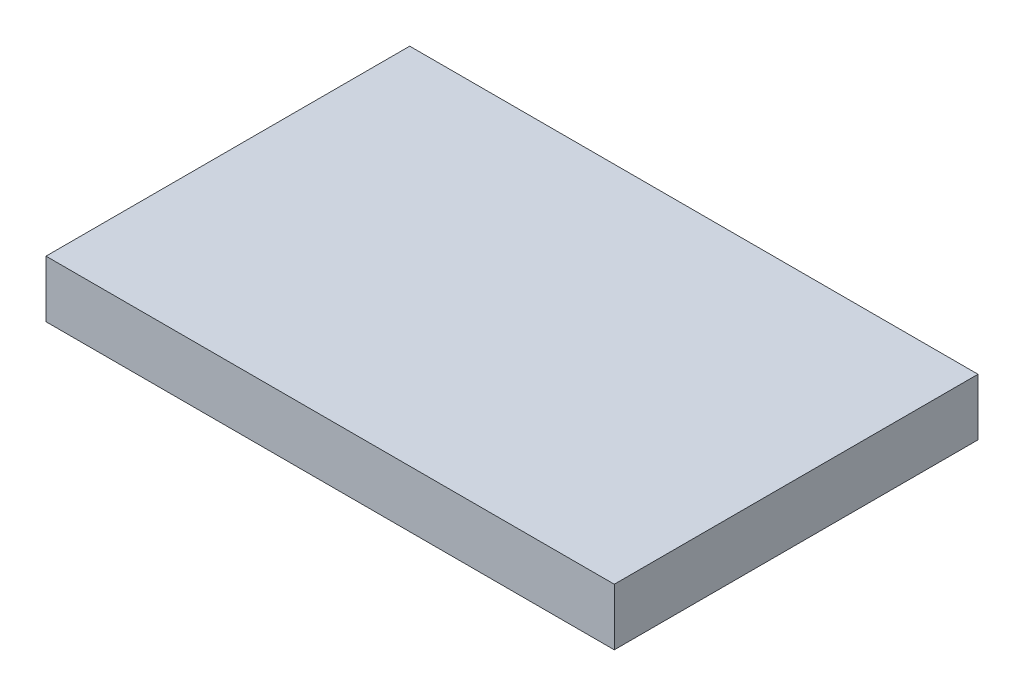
ISO-10303-21;
HEADER;
FILE_DESCRIPTION(('STEP AP214'),'2;1');
FILE_NAME('part.step','',(''),(''),'','','');
FILE_SCHEMA(('AUTOMOTIVE_DESIGN { 1 0 10303 214 1 1 1 1 }'));
ENDSEC;
DATA;
#1=APPLICATION_CONTEXT('core data for automotive mechanical design processes');
#2=APPLICATION_PROTOCOL_DEFINITION('international standard','automotive_design',2000,#1);
#3=PRODUCT_CONTEXT('',#1,'mechanical');
#4=PRODUCT('Part','Part','',(#3));
#5=PRODUCT_RELATED_PRODUCT_CATEGORY('part','',(#4));
#6=PRODUCT_DEFINITION_FORMATION('','',#4);
#7=PRODUCT_DEFINITION_CONTEXT('part definition',#1,'design');
#8=PRODUCT_DEFINITION('design','',#6,#7);
#9=PRODUCT_DEFINITION_SHAPE('','',#8);
#10=(LENGTH_UNIT() NAMED_UNIT(*) SI_UNIT(.MILLI.,.METRE.));
#11=(NAMED_UNIT(*) PLANE_ANGLE_UNIT() SI_UNIT($,.RADIAN.));
#12=(NAMED_UNIT(*) SI_UNIT($,.STERADIAN.) SOLID_ANGLE_UNIT());
#13=UNCERTAINTY_MEASURE_WITH_UNIT(LENGTH_MEASURE(1.E-05),#10,'distance_accuracy_value','');
#14=(GEOMETRIC_REPRESENTATION_CONTEXT(3) GLOBAL_UNCERTAINTY_ASSIGNED_CONTEXT((#13)) GLOBAL_UNIT_ASSIGNED_CONTEXT((#10,
#11,#12)) REPRESENTATION_CONTEXT('',''));
#15=CARTESIAN_POINT('',(0.,0.,0.));
#16=DIRECTION('',(0.,0.,1.));
#17=DIRECTION('',(1.,0.,0.));
#18=AXIS2_PLACEMENT_3D('',#15,#16,#17);
#19=CARTESIAN_POINT('',(0.,10.,0.));
#20=DIRECTION('',(1.,0.,0.));
#21=DIRECTION('',(0.,0.,-1.));
#22=AXIS2_PLACEMENT_3D('',#19,#20,#21);
#23=PLANE('',#22);
#24=DIRECTION('',(0.,0.,1.));
#25=VECTOR('',#24,1.);
#26=CARTESIAN_POINT('',(0.,0.,0.));
#27=LINE('',#26,#25);
#28=CARTESIAN_POINT('',(0.,0.,-64.));
#29=VERTEX_POINT('',#28);
#30=CARTESIAN_POINT('',(0.,0.,0.));
#31=VERTEX_POINT('',#30);
#32=EDGE_CURVE('E98',#29,#31,#27,.T.);
#33=ORIENTED_EDGE('',*,*,#32,.T.);
#34=DIRECTION('',(0.,-1.,0.));
#35=VECTOR('',#34,1.);
#36=CARTESIAN_POINT('',(0.,10.,0.));
#37=LINE('',#36,#35);
#38=CARTESIAN_POINT('',(0.,10.,0.));
#39=VERTEX_POINT('',#38);
#40=EDGE_CURVE('E11',#39,#31,#37,.T.);
#41=ORIENTED_EDGE('',*,*,#40,.F.);
#42=DIRECTION('',(0.,0.,1.));
#43=VECTOR('',#42,1.);
#44=CARTESIAN_POINT('',(0.,10.,0.));
#45=LINE('',#44,#43);
#46=CARTESIAN_POINT('',(0.,10.,-64.));
#47=VERTEX_POINT('',#46);
#48=EDGE_CURVE('E86',#47,#39,#45,.T.);
#49=ORIENTED_EDGE('',*,*,#48,.F.);
#50=DIRECTION('',(0.,-1.,0.));
#51=VECTOR('',#50,1.);
#52=CARTESIAN_POINT('',(0.,10.,-64.));
#53=LINE('',#52,#51);
#54=EDGE_CURVE('E94',#47,#29,#53,.T.);
#55=ORIENTED_EDGE('',*,*,#54,.T.);
#56=EDGE_LOOP('',(#33,#41,#49,#55));
#57=FACE_BOUND('',#56,.T.);
#58=ADVANCED_FACE('F35',(#57),#23,.F.);
#59=CARTESIAN_POINT('',(0.,10.,0.));
#60=DIRECTION('',(0.,0.,-1.));
#61=DIRECTION('',(-1.,0.,0.));
#62=AXIS2_PLACEMENT_3D('',#59,#60,#61);
#63=PLANE('',#62);
#64=DIRECTION('',(1.,0.,0.));
#65=VECTOR('',#64,1.);
#66=CARTESIAN_POINT('',(0.,0.,0.));
#67=LINE('',#66,#65);
#68=CARTESIAN_POINT('',(100.,0.,0.));
#69=VERTEX_POINT('',#68);
#70=EDGE_CURVE('E90',#31,#69,#67,.T.);
#71=ORIENTED_EDGE('',*,*,#70,.T.);
#72=DIRECTION('',(0.,-1.,0.));
#73=VECTOR('',#72,1.);
#74=CARTESIAN_POINT('',(100.,10.,0.));
#75=LINE('',#74,#73);
#76=CARTESIAN_POINT('',(100.,10.,0.));
#77=VERTEX_POINT('',#76);
#78=EDGE_CURVE('E43',#77,#69,#75,.T.);
#79=ORIENTED_EDGE('',*,*,#78,.F.);
#80=DIRECTION('',(1.,0.,0.));
#81=VECTOR('',#80,1.);
#82=CARTESIAN_POINT('',(0.,10.,0.));
#83=LINE('',#82,#81);
#84=EDGE_CURVE('E81',#39,#77,#83,.T.);
#85=ORIENTED_EDGE('',*,*,#84,.F.);
#86=ORIENTED_EDGE('',*,*,#40,.T.);
#87=EDGE_LOOP('',(#71,#79,#85,#86));
#88=FACE_BOUND('',#87,.T.);
#89=ADVANCED_FACE('F89',(#88),#63,.F.);
#90=CARTESIAN_POINT('',(100.,10.,0.));
#91=DIRECTION('',(-1.,0.,0.));
#92=DIRECTION('',(0.,0.,1.));
#93=AXIS2_PLACEMENT_3D('',#90,#91,#92);
#94=PLANE('',#93);
#95=DIRECTION('',(0.,0.,-1.));
#96=VECTOR('',#95,1.);
#97=CARTESIAN_POINT('',(100.,0.,0.));
#98=LINE('',#97,#96);
#99=CARTESIAN_POINT('',(100.,0.,-64.));
#100=VERTEX_POINT('',#99);
#101=EDGE_CURVE('E68',#69,#100,#98,.T.);
#102=ORIENTED_EDGE('',*,*,#101,.T.);
#103=DIRECTION('',(0.,-1.,0.));
#104=VECTOR('',#103,1.);
#105=CARTESIAN_POINT('',(100.,10.,-64.));
#106=LINE('',#105,#104);
#107=CARTESIAN_POINT('',(100.,10.,-64.));
#108=VERTEX_POINT('',#107);
#109=EDGE_CURVE('E91',#108,#100,#106,.T.);
#110=ORIENTED_EDGE('',*,*,#109,.F.);
#111=DIRECTION('',(0.,0.,-1.));
#112=VECTOR('',#111,1.);
#113=CARTESIAN_POINT('',(100.,10.,0.));
#114=LINE('',#113,#112);
#115=EDGE_CURVE('E84',#77,#108,#114,.T.);
#116=ORIENTED_EDGE('',*,*,#115,.F.);
#117=ORIENTED_EDGE('',*,*,#78,.T.);
#118=EDGE_LOOP('',(#102,#110,#116,#117));
#119=FACE_BOUND('',#118,.T.);
#120=ADVANCED_FACE('F92',(#119),#94,.F.);
#121=CARTESIAN_POINT('',(0.,10.,-64.));
#122=DIRECTION('',(0.,0.,1.));
#123=DIRECTION('',(1.,0.,0.));
#124=AXIS2_PLACEMENT_3D('',#121,#122,#123);
#125=PLANE('',#124);
#126=DIRECTION('',(-1.,0.,0.));
#127=VECTOR('',#126,1.);
#128=CARTESIAN_POINT('',(0.,0.,-64.));
#129=LINE('',#128,#127);
#130=EDGE_CURVE('E74',#100,#29,#129,.T.);
#131=ORIENTED_EDGE('',*,*,#130,.T.);
#132=ORIENTED_EDGE('',*,*,#54,.F.);
#133=DIRECTION('',(-1.,0.,0.));
#134=VECTOR('',#133,1.);
#135=CARTESIAN_POINT('',(0.,10.,-64.));
#136=LINE('',#135,#134);
#137=EDGE_CURVE('E51',#108,#47,#136,.T.);
#138=ORIENTED_EDGE('',*,*,#137,.F.);
#139=ORIENTED_EDGE('',*,*,#109,.T.);
#140=EDGE_LOOP('',(#131,#132,#138,#139));
#141=FACE_BOUND('',#140,.T.);
#142=ADVANCED_FACE('F105',(#141),#125,.F.);
#143=CARTESIAN_POINT('',(0.,10.,0.));
#144=DIRECTION('',(0.,-1.,0.));
#145=DIRECTION('',(0.,0.,-1.));
#146=AXIS2_PLACEMENT_3D('',#143,#144,#145);
#147=PLANE('',#146);
#148=ORIENTED_EDGE('',*,*,#48,.T.);
#149=ORIENTED_EDGE('',*,*,#84,.T.);
#150=ORIENTED_EDGE('',*,*,#115,.T.);
#151=ORIENTED_EDGE('',*,*,#137,.T.);
#152=EDGE_LOOP('',(#148,#149,#150,#151));
#153=FACE_BOUND('',#152,.T.);
#154=ADVANCED_FACE('F82',(#153),#147,.F.);
#155=CARTESIAN_POINT('',(0.,0.,0.));
#156=DIRECTION('',(0.,-1.,0.));
#157=DIRECTION('',(0.,0.,-1.));
#158=AXIS2_PLACEMENT_3D('',#155,#156,#157);
#159=PLANE('',#158);
#160=ORIENTED_EDGE('',*,*,#32,.F.);
#161=ORIENTED_EDGE('',*,*,#130,.F.);
#162=ORIENTED_EDGE('',*,*,#101,.F.);
#163=ORIENTED_EDGE('',*,*,#70,.F.);
#164=EDGE_LOOP('',(#160,#161,#162,#163));
#165=FACE_BOUND('',#164,.T.);
#166=ADVANCED_FACE('F108',(#165),#159,.T.);
#167=CLOSED_SHELL('',(#58,#89,#120,#142,#154,#166));
#168=MANIFOLD_SOLID_BREP('B2',#167);
#169=ADVANCED_BREP_SHAPE_REPRESENTATION('',(#18,#168),#14);
#170=SHAPE_DEFINITION_REPRESENTATION(#9,#169);
ENDSEC;
END-ISO-10303-21;
